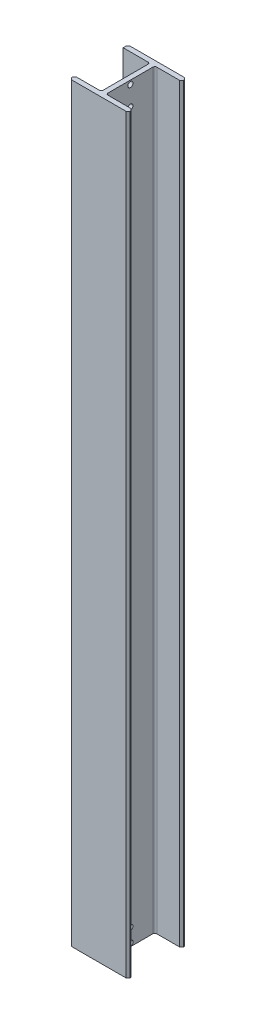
ISO-10303-21;
HEADER;
FILE_DESCRIPTION(('STEP AP214'),'2;1');
FILE_NAME('part.step','',(''),(''),'','','');
FILE_SCHEMA(('AUTOMOTIVE_DESIGN { 1 0 10303 214 1 1 1 1 }'));
ENDSEC;
DATA;
#1=APPLICATION_CONTEXT('core data for automotive mechanical design processes');
#2=APPLICATION_PROTOCOL_DEFINITION('international standard','automotive_design',2000,#1);
#3=PRODUCT_CONTEXT('',#1,'mechanical');
#4=PRODUCT('Part','Part','',(#3));
#5=PRODUCT_RELATED_PRODUCT_CATEGORY('part','',(#4));
#6=PRODUCT_DEFINITION_FORMATION('','',#4);
#7=PRODUCT_DEFINITION_CONTEXT('part definition',#1,'design');
#8=PRODUCT_DEFINITION('design','',#6,#7);
#9=PRODUCT_DEFINITION_SHAPE('','',#8);
#10=(LENGTH_UNIT() NAMED_UNIT(*) SI_UNIT(.MILLI.,.METRE.));
#11=(NAMED_UNIT(*) PLANE_ANGLE_UNIT() SI_UNIT($,.RADIAN.));
#12=(NAMED_UNIT(*) SI_UNIT($,.STERADIAN.) SOLID_ANGLE_UNIT());
#13=UNCERTAINTY_MEASURE_WITH_UNIT(LENGTH_MEASURE(1.E-05),#10,'distance_accuracy_value','');
#14=(GEOMETRIC_REPRESENTATION_CONTEXT(3) GLOBAL_UNCERTAINTY_ASSIGNED_CONTEXT((#13)) GLOBAL_UNIT_ASSIGNED_CONTEXT((#10,
#11,#12)) REPRESENTATION_CONTEXT('',''));
#15=CARTESIAN_POINT('',(0.,0.,0.));
#16=DIRECTION('',(0.,0.,1.));
#17=DIRECTION('',(1.,0.,0.));
#18=AXIS2_PLACEMENT_3D('',#15,#16,#17);
#19=CARTESIAN_POINT('',(0.,977.9,0.));
#20=DIRECTION('',(0.,0.,1.));
#21=DIRECTION('',(1.,0.,0.));
#22=AXIS2_PLACEMENT_3D('',#19,#20,#21);
#23=PLANE('',#22);
#24=DIRECTION('',(-1.,0.,0.));
#25=VECTOR('',#24,1.);
#26=CARTESIAN_POINT('',(34.925,977.9,0.));
#27=LINE('',#26,#25);
#28=CARTESIAN_POINT('',(32.3850000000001,977.9,0.));
#29=VERTEX_POINT('',#28);
#30=CARTESIAN_POINT('',(-38.7350000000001,977.9,0.));
#31=VERTEX_POINT('',#30);
#32=EDGE_CURVE('E246',#29,#31,#27,.T.);
#33=ORIENTED_EDGE('',*,*,#32,.F.);
#34=DIRECTION('',(0.,-1.,0.));
#35=VECTOR('',#34,1.);
#36=CARTESIAN_POINT('',(32.3850000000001,977.9,0.));
#37=LINE('',#36,#35);
#38=CARTESIAN_POINT('',(32.3850000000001,0.,0.));
#39=VERTEX_POINT('',#38);
#40=EDGE_CURVE('E359',#29,#39,#37,.T.);
#41=ORIENTED_EDGE('',*,*,#40,.T.);
#42=DIRECTION('',(-1.,0.,0.));
#43=VECTOR('',#42,1.);
#44=CARTESIAN_POINT('',(0.,0.,0.));
#45=LINE('',#44,#43);
#46=CARTESIAN_POINT('',(-38.7350000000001,0.,0.));
#47=VERTEX_POINT('',#46);
#48=EDGE_CURVE('E203',#39,#47,#45,.T.);
#49=ORIENTED_EDGE('',*,*,#48,.T.);
#50=DIRECTION('',(0.,1.,0.));
#51=VECTOR('',#50,1.);
#52=CARTESIAN_POINT('',(-38.7350000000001,977.9,0.));
#53=LINE('',#52,#51);
#54=EDGE_CURVE('E357',#47,#31,#53,.T.);
#55=ORIENTED_EDGE('',*,*,#54,.T.);
#56=EDGE_LOOP('',(#33,#41,#49,#55));
#57=FACE_BOUND('',#56,.T.);
#58=ADVANCED_FACE('F36',(#57),#23,.F.);
#59=CARTESIAN_POINT('',(-41.275,977.9,0.));
#60=DIRECTION('',(1.,0.,0.));
#61=DIRECTION('',(0.,0.,-1.));
#62=AXIS2_PLACEMENT_3D('',#59,#60,#61);
#63=PLANE('',#62);
#64=DIRECTION('',(0.,0.,1.));
#65=VECTOR('',#64,1.);
#66=CARTESIAN_POINT('',(-41.275,977.9,0.));
#67=LINE('',#66,#65);
#68=CARTESIAN_POINT('',(-41.275,977.9,2.53999999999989));
#69=VERTEX_POINT('',#68);
#70=CARTESIAN_POINT('',(-41.275,977.9,6.35));
#71=VERTEX_POINT('',#70);
#72=EDGE_CURVE('E249',#69,#71,#67,.T.);
#73=ORIENTED_EDGE('',*,*,#72,.F.);
#74=DIRECTION('',(0.,-1.,0.));
#75=VECTOR('',#74,1.);
#76=CARTESIAN_POINT('',(-41.275,977.9,2.53999999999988));
#77=LINE('',#76,#75);
#78=CARTESIAN_POINT('',(-41.275,0.,2.53999999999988));
#79=VERTEX_POINT('',#78);
#80=EDGE_CURVE('E199',#69,#79,#77,.T.);
#81=ORIENTED_EDGE('',*,*,#80,.T.);
#82=DIRECTION('',(0.,0.,1.));
#83=VECTOR('',#82,1.);
#84=CARTESIAN_POINT('',(-41.275,0.,0.));
#85=LINE('',#84,#83);
#86=CARTESIAN_POINT('',(-41.275,0.,6.35));
#87=VERTEX_POINT('',#86);
#88=EDGE_CURVE('E192',#79,#87,#85,.T.);
#89=ORIENTED_EDGE('',*,*,#88,.T.);
#90=DIRECTION('',(0.,-1.,0.));
#91=VECTOR('',#90,1.);
#92=CARTESIAN_POINT('',(-41.275,977.9,6.35));
#93=LINE('',#92,#91);
#94=EDGE_CURVE('E196',#71,#87,#93,.T.);
#95=ORIENTED_EDGE('',*,*,#94,.F.);
#96=EDGE_LOOP('',(#73,#81,#89,#95));
#97=FACE_BOUND('',#96,.T.);
#98=ADVANCED_FACE('F195',(#97),#63,.F.);
#99=CARTESIAN_POINT('',(-41.275,977.9,6.35));
#100=DIRECTION('',(0.,0.,-1.));
#101=DIRECTION('',(-1.,0.,0.));
#102=AXIS2_PLACEMENT_3D('',#99,#100,#101);
#103=PLANE('',#102);
#104=DIRECTION('',(1.,0.,0.));
#105=VECTOR('',#104,1.);
#106=CARTESIAN_POINT('',(-41.275,0.,6.35));
#107=LINE('',#106,#105);
#108=CARTESIAN_POINT('',(-8.89,0.,6.35));
#109=VERTEX_POINT('',#108);
#110=EDGE_CURVE('E202',#87,#109,#107,.T.);
#111=ORIENTED_EDGE('',*,*,#110,.T.);
#112=DIRECTION('',(0.,-1.,0.));
#113=VECTOR('',#112,1.);
#114=CARTESIAN_POINT('',(-8.89,977.9,6.35));
#115=LINE('',#114,#113);
#116=CARTESIAN_POINT('',(-8.89,977.9,6.35));
#117=VERTEX_POINT('',#116);
#118=EDGE_CURVE('E279',#109,#117,#115,.F.);
#119=ORIENTED_EDGE('',*,*,#118,.T.);
#120=DIRECTION('',(1.,0.,0.));
#121=VECTOR('',#120,1.);
#122=CARTESIAN_POINT('',(-41.275,977.9,6.35));
#123=LINE('',#122,#121);
#124=EDGE_CURVE('E210',#71,#117,#123,.T.);
#125=ORIENTED_EDGE('',*,*,#124,.F.);
#126=ORIENTED_EDGE('',*,*,#94,.T.);
#127=EDGE_LOOP('',(#111,#119,#125,#126));
#128=FACE_BOUND('',#127,.T.);
#129=ADVANCED_FACE('F207',(#128),#103,.F.);
#130=CARTESIAN_POINT('',(-6.35,977.9,6.35));
#131=DIRECTION('',(1.,0.,0.));
#132=DIRECTION('',(0.,0.,-1.));
#133=AXIS2_PLACEMENT_3D('',#130,#131,#132);
#134=PLANE('',#133);
#135=CARTESIAN_POINT('',(-6.34999999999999,21.59,38.1));
#136=DIRECTION('',(1.,0.,0.));
#137=DIRECTION('',(0.,0.,-1.));
#138=AXIS2_PLACEMENT_3D('',#135,#136,#137);
#139=CIRCLE('',#138,3.3782);
#140=CARTESIAN_POINT('',(-6.34999999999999,21.59,34.7218));
#141=VERTEX_POINT('',#140);
#142=EDGE_CURVE('E590',#141,#141,#139,.T.);
#143=ORIENTED_EDGE('',*,*,#142,.T.);
#144=EDGE_LOOP('',(#143));
#145=FACE_BOUND('',#144,.T.);
#146=CARTESIAN_POINT('',(-6.34999999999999,3.81,38.1));
#147=DIRECTION('',(1.,0.,0.));
#148=DIRECTION('',(0.,0.,-1.));
#149=AXIS2_PLACEMENT_3D('',#146,#147,#148);
#150=CIRCLE('',#149,3.3782);
#151=CARTESIAN_POINT('',(-6.34999999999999,3.81,34.7218));
#152=VERTEX_POINT('',#151);
#153=EDGE_CURVE('E594',#152,#152,#150,.T.);
#154=ORIENTED_EDGE('',*,*,#153,.T.);
#155=EDGE_LOOP('',(#154));
#156=FACE_BOUND('',#155,.T.);
#157=CARTESIAN_POINT('',(-6.34999999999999,947.42,38.1));
#158=DIRECTION('',(1.,0.,0.));
#159=DIRECTION('',(0.,0.,-1.));
#160=AXIS2_PLACEMENT_3D('',#157,#158,#159);
#161=CIRCLE('',#160,3.3782);
#162=CARTESIAN_POINT('',(-6.34999999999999,947.42,34.7218));
#163=VERTEX_POINT('',#162);
#164=EDGE_CURVE('E603',#163,#163,#161,.T.);
#165=ORIENTED_EDGE('',*,*,#164,.T.);
#166=EDGE_LOOP('',(#165));
#167=FACE_BOUND('',#166,.T.);
#168=CARTESIAN_POINT('',(-6.34999999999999,972.82,38.1));
#169=DIRECTION('',(1.,0.,0.));
#170=DIRECTION('',(0.,0.,-1.));
#171=AXIS2_PLACEMENT_3D('',#168,#169,#170);
#172=CIRCLE('',#171,3.3782);
#173=CARTESIAN_POINT('',(-6.34999999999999,972.82,34.7218));
#174=VERTEX_POINT('',#173);
#175=EDGE_CURVE('E609',#174,#174,#172,.T.);
#176=ORIENTED_EDGE('',*,*,#175,.T.);
#177=EDGE_LOOP('',(#176));
#178=FACE_BOUND('',#177,.T.);
#179=DIRECTION('',(0.,0.,1.));
#180=VECTOR('',#179,1.);
#181=CARTESIAN_POINT('',(-6.35,977.9,6.35));
#182=LINE('',#181,#180);
#183=CARTESIAN_POINT('',(-6.35,977.9,8.89000000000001));
#184=VERTEX_POINT('',#183);
#185=CARTESIAN_POINT('',(-6.34999999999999,977.9,67.31));
#186=VERTEX_POINT('',#185);
#187=EDGE_CURVE('E252',#184,#186,#182,.T.);
#188=ORIENTED_EDGE('',*,*,#187,.F.);
#189=DIRECTION('',(0.,-1.,0.));
#190=VECTOR('',#189,1.);
#191=CARTESIAN_POINT('',(-6.35,0.,8.89000000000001));
#192=LINE('',#191,#190);
#193=CARTESIAN_POINT('',(-6.35,0.,8.89000000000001));
#194=VERTEX_POINT('',#193);
#195=EDGE_CURVE('E276',#184,#194,#192,.T.);
#196=ORIENTED_EDGE('',*,*,#195,.T.);
#197=DIRECTION('',(0.,0.,1.));
#198=VECTOR('',#197,1.);
#199=CARTESIAN_POINT('',(-6.35,0.,6.35));
#200=LINE('',#199,#198);
#201=CARTESIAN_POINT('',(-6.34999999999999,0.,67.31));
#202=VERTEX_POINT('',#201);
#203=EDGE_CURVE('E218',#194,#202,#200,.T.);
#204=ORIENTED_EDGE('',*,*,#203,.T.);
#205=DIRECTION('',(0.,-1.,0.));
#206=VECTOR('',#205,1.);
#207=CARTESIAN_POINT('',(-6.34999999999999,977.9,67.31));
#208=LINE('',#207,#206);
#209=EDGE_CURVE('E211',#202,#186,#208,.F.);
#210=ORIENTED_EDGE('',*,*,#209,.T.);
#211=EDGE_LOOP('',(#188,#196,#204,#210));
#212=FACE_BOUND('',#211,.T.);
#213=ADVANCED_FACE('F452',(#145,#156,#167,#178,#212),#134,.F.);
#214=CARTESIAN_POINT('',(-6.34999999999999,977.9,69.85));
#215=DIRECTION('',(0.,0.,1.));
#216=DIRECTION('',(1.,0.,0.));
#217=AXIS2_PLACEMENT_3D('',#214,#215,#216);
#218=PLANE('',#217);
#219=DIRECTION('',(-1.,0.,0.));
#220=VECTOR('',#219,1.);
#221=CARTESIAN_POINT('',(-6.34999999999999,0.,69.85));
#222=LINE('',#221,#220);
#223=CARTESIAN_POINT('',(-8.88999999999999,0.,69.85));
#224=VERTEX_POINT('',#223);
#225=CARTESIAN_POINT('',(-38.735,0.,69.85));
#226=VERTEX_POINT('',#225);
#227=EDGE_CURVE('E221',#224,#226,#222,.T.);
#228=ORIENTED_EDGE('',*,*,#227,.T.);
#229=DIRECTION('',(0.,1.,0.));
#230=VECTOR('',#229,1.);
#231=CARTESIAN_POINT('',(-38.735,977.9,69.85));
#232=LINE('',#231,#230);
#233=CARTESIAN_POINT('',(-38.735,977.9,69.85));
#234=VERTEX_POINT('',#233);
#235=EDGE_CURVE('E11',#226,#234,#232,.T.);
#236=ORIENTED_EDGE('',*,*,#235,.T.);
#237=DIRECTION('',(-1.,0.,0.));
#238=VECTOR('',#237,1.);
#239=CARTESIAN_POINT('',(-6.34999999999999,977.9,69.85));
#240=LINE('',#239,#238);
#241=CARTESIAN_POINT('',(-8.88999999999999,977.9,69.85));
#242=VERTEX_POINT('',#241);
#243=EDGE_CURVE('E255',#242,#234,#240,.T.);
#244=ORIENTED_EDGE('',*,*,#243,.F.);
#245=DIRECTION('',(0.,-1.,0.));
#246=VECTOR('',#245,1.);
#247=CARTESIAN_POINT('',(-8.88999999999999,0.,69.85));
#248=LINE('',#247,#246);
#249=EDGE_CURVE('E281',#242,#224,#248,.T.);
#250=ORIENTED_EDGE('',*,*,#249,.T.);
#251=EDGE_LOOP('',(#228,#236,#244,#250));
#252=FACE_BOUND('',#251,.T.);
#253=ADVANCED_FACE('F457',(#252),#218,.F.);
#254=CARTESIAN_POINT('',(-41.275,977.9,69.85));
#255=DIRECTION('',(1.,0.,0.));
#256=DIRECTION('',(0.,0.,-1.));
#257=AXIS2_PLACEMENT_3D('',#254,#255,#256);
#258=PLANE('',#257);
#259=DIRECTION('',(0.,0.,1.));
#260=VECTOR('',#259,1.);
#261=CARTESIAN_POINT('',(-41.275,977.9,69.85));
#262=LINE('',#261,#260);
#263=CARTESIAN_POINT('',(-41.275,977.9,72.39));
#264=VERTEX_POINT('',#263);
#265=CARTESIAN_POINT('',(-41.275,977.9,73.6600000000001));
#266=VERTEX_POINT('',#265);
#267=EDGE_CURVE('E258',#264,#266,#262,.T.);
#268=ORIENTED_EDGE('',*,*,#267,.F.);
#269=DIRECTION('',(0.,-1.,0.));
#270=VECTOR('',#269,1.);
#271=CARTESIAN_POINT('',(-41.275,977.9,72.39));
#272=LINE('',#271,#270);
#273=CARTESIAN_POINT('',(-41.275,0.,72.39));
#274=VERTEX_POINT('',#273);
#275=EDGE_CURVE('E43',#264,#274,#272,.T.);
#276=ORIENTED_EDGE('',*,*,#275,.T.);
#277=DIRECTION('',(0.,0.,1.));
#278=VECTOR('',#277,1.);
#279=CARTESIAN_POINT('',(-41.275,0.,69.85));
#280=LINE('',#279,#278);
#281=CARTESIAN_POINT('',(-41.275,0.,73.6600000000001));
#282=VERTEX_POINT('',#281);
#283=EDGE_CURVE('E227',#274,#282,#280,.T.);
#284=ORIENTED_EDGE('',*,*,#283,.T.);
#285=DIRECTION('',(0.,1.,0.));
#286=VECTOR('',#285,1.);
#287=CARTESIAN_POINT('',(-41.275,977.9,73.6600000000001));
#288=LINE('',#287,#286);
#289=EDGE_CURVE('E363',#282,#266,#288,.T.);
#290=ORIENTED_EDGE('',*,*,#289,.T.);
#291=EDGE_LOOP('',(#268,#276,#284,#290));
#292=FACE_BOUND('',#291,.T.);
#293=ADVANCED_FACE('F369',(#292),#258,.F.);
#294=CARTESIAN_POINT('',(-41.275,977.9,76.2));
#295=DIRECTION('',(0.,0.,-1.));
#296=DIRECTION('',(-1.,0.,0.));
#297=AXIS2_PLACEMENT_3D('',#294,#295,#296);
#298=PLANE('',#297);
#299=DIRECTION('',(1.,0.,0.));
#300=VECTOR('',#299,1.);
#301=CARTESIAN_POINT('',(-41.275,0.,76.2));
#302=LINE('',#301,#300);
#303=CARTESIAN_POINT('',(-38.7350000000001,0.,76.2));
#304=VERTEX_POINT('',#303);
#305=CARTESIAN_POINT('',(32.385,0.,76.2));
#306=VERTEX_POINT('',#305);
#307=EDGE_CURVE('E230',#304,#306,#302,.T.);
#308=ORIENTED_EDGE('',*,*,#307,.T.);
#309=DIRECTION('',(0.,1.,0.));
#310=VECTOR('',#309,1.);
#311=CARTESIAN_POINT('',(32.385,977.9,76.2));
#312=LINE('',#311,#310);
#313=CARTESIAN_POINT('',(32.385,977.9,76.2));
#314=VERTEX_POINT('',#313);
#315=EDGE_CURVE('E333',#306,#314,#312,.T.);
#316=ORIENTED_EDGE('',*,*,#315,.T.);
#317=DIRECTION('',(1.,0.,0.));
#318=VECTOR('',#317,1.);
#319=CARTESIAN_POINT('',(-41.275,977.9,76.2));
#320=LINE('',#319,#318);
#321=CARTESIAN_POINT('',(-38.7350000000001,977.9,76.2));
#322=VERTEX_POINT('',#321);
#323=EDGE_CURVE('E261',#322,#314,#320,.T.);
#324=ORIENTED_EDGE('',*,*,#323,.F.);
#325=DIRECTION('',(0.,-1.,0.));
#326=VECTOR('',#325,1.);
#327=CARTESIAN_POINT('',(-38.7350000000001,977.9,76.2));
#328=LINE('',#327,#326);
#329=EDGE_CURVE('E330',#322,#304,#328,.T.);
#330=ORIENTED_EDGE('',*,*,#329,.T.);
#331=EDGE_LOOP('',(#308,#316,#324,#330));
#332=FACE_BOUND('',#331,.T.);
#333=ADVANCED_FACE('F381',(#332),#298,.F.);
#334=CARTESIAN_POINT('',(34.925,977.9,76.2));
#335=DIRECTION('',(-1.,0.,0.));
#336=DIRECTION('',(0.,0.,1.));
#337=AXIS2_PLACEMENT_3D('',#334,#335,#336);
#338=PLANE('',#337);
#339=DIRECTION('',(0.,0.,-1.));
#340=VECTOR('',#339,1.);
#341=CARTESIAN_POINT('',(34.925,977.9,76.2));
#342=LINE('',#341,#340);
#343=CARTESIAN_POINT('',(34.925,977.9,73.66));
#344=VERTEX_POINT('',#343);
#345=CARTESIAN_POINT('',(34.925,977.9,72.3899999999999));
#346=VERTEX_POINT('',#345);
#347=EDGE_CURVE('E264',#344,#346,#342,.T.);
#348=ORIENTED_EDGE('',*,*,#347,.F.);
#349=DIRECTION('',(0.,-1.,0.));
#350=VECTOR('',#349,1.);
#351=CARTESIAN_POINT('',(34.925,977.9,73.66));
#352=LINE('',#351,#350);
#353=CARTESIAN_POINT('',(34.925,0.,73.66));
#354=VERTEX_POINT('',#353);
#355=EDGE_CURVE('E313',#344,#354,#352,.T.);
#356=ORIENTED_EDGE('',*,*,#355,.T.);
#357=DIRECTION('',(0.,0.,-1.));
#358=VECTOR('',#357,1.);
#359=CARTESIAN_POINT('',(34.925,0.,76.2));
#360=LINE('',#359,#358);
#361=CARTESIAN_POINT('',(34.925,0.,72.3899999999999));
#362=VERTEX_POINT('',#361);
#363=EDGE_CURVE('E233',#354,#362,#360,.T.);
#364=ORIENTED_EDGE('',*,*,#363,.T.);
#365=DIRECTION('',(0.,1.,0.));
#366=VECTOR('',#365,1.);
#367=CARTESIAN_POINT('',(34.925,977.9,72.3899999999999));
#368=LINE('',#367,#366);
#369=EDGE_CURVE('E311',#362,#346,#368,.T.);
#370=ORIENTED_EDGE('',*,*,#369,.T.);
#371=EDGE_LOOP('',(#348,#356,#364,#370));
#372=FACE_BOUND('',#371,.T.);
#373=ADVANCED_FACE('F390',(#372),#338,.F.);
#374=CARTESIAN_POINT('',(34.925,977.9,69.85));
#375=DIRECTION('',(0.,0.,1.));
#376=DIRECTION('',(1.,0.,0.));
#377=AXIS2_PLACEMENT_3D('',#374,#375,#376);
#378=PLANE('',#377);
#379=DIRECTION('',(-1.,0.,0.));
#380=VECTOR('',#379,1.);
#381=CARTESIAN_POINT('',(34.925,977.9,69.85));
#382=LINE('',#381,#380);
#383=CARTESIAN_POINT('',(32.3850000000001,977.9,69.85));
#384=VERTEX_POINT('',#383);
#385=CARTESIAN_POINT('',(2.54000000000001,977.9,69.85));
#386=VERTEX_POINT('',#385);
#387=EDGE_CURVE('E267',#384,#386,#382,.T.);
#388=ORIENTED_EDGE('',*,*,#387,.F.);
#389=DIRECTION('',(0.,-1.,0.));
#390=VECTOR('',#389,1.);
#391=CARTESIAN_POINT('',(32.3850000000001,977.9,69.85));
#392=LINE('',#391,#390);
#393=CARTESIAN_POINT('',(32.3850000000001,0.,69.85));
#394=VERTEX_POINT('',#393);
#395=EDGE_CURVE('E348',#384,#394,#392,.T.);
#396=ORIENTED_EDGE('',*,*,#395,.T.);
#397=DIRECTION('',(-1.,0.,0.));
#398=VECTOR('',#397,1.);
#399=CARTESIAN_POINT('',(34.925,0.,69.85));
#400=LINE('',#399,#398);
#401=CARTESIAN_POINT('',(2.54000000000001,0.,69.85));
#402=VERTEX_POINT('',#401);
#403=EDGE_CURVE('E236',#394,#402,#400,.T.);
#404=ORIENTED_EDGE('',*,*,#403,.T.);
#405=DIRECTION('',(0.,-1.,0.));
#406=VECTOR('',#405,1.);
#407=CARTESIAN_POINT('',(2.54,977.9,69.85));
#408=LINE('',#407,#406);
#409=EDGE_CURVE('E289',#402,#386,#408,.F.);
#410=ORIENTED_EDGE('',*,*,#409,.T.);
#411=EDGE_LOOP('',(#388,#396,#404,#410));
#412=FACE_BOUND('',#411,.T.);
#413=ADVANCED_FACE('F399',(#412),#378,.F.);
#414=CARTESIAN_POINT('',(0.,977.9,69.85));
#415=DIRECTION('',(-1.,0.,0.));
#416=DIRECTION('',(0.,0.,1.));
#417=AXIS2_PLACEMENT_3D('',#414,#415,#416);
#418=PLANE('',#417);
#419=CARTESIAN_POINT('',(0.,21.59,38.1));
#420=DIRECTION('',(1.,0.,0.));
#421=DIRECTION('',(0.,0.,-1.));
#422=AXIS2_PLACEMENT_3D('',#419,#420,#421);
#423=CIRCLE('',#422,3.3782);
#424=CARTESIAN_POINT('',(0.,21.59,34.7218));
#425=VERTEX_POINT('',#424);
#426=EDGE_CURVE('E587',#425,#425,#423,.T.);
#427=ORIENTED_EDGE('',*,*,#426,.F.);
#428=EDGE_LOOP('',(#427));
#429=FACE_BOUND('',#428,.T.);
#430=CARTESIAN_POINT('',(0.,3.81,38.1));
#431=DIRECTION('',(1.,0.,0.));
#432=DIRECTION('',(0.,0.,-1.));
#433=AXIS2_PLACEMENT_3D('',#430,#431,#432);
#434=CIRCLE('',#433,3.3782);
#435=CARTESIAN_POINT('',(0.,3.81,34.7218));
#436=VERTEX_POINT('',#435);
#437=EDGE_CURVE('E591',#436,#436,#434,.T.);
#438=ORIENTED_EDGE('',*,*,#437,.F.);
#439=EDGE_LOOP('',(#438));
#440=FACE_BOUND('',#439,.T.);
#441=CARTESIAN_POINT('',(0.,947.42,38.1));
#442=DIRECTION('',(1.,0.,0.));
#443=DIRECTION('',(0.,0.,-1.));
#444=AXIS2_PLACEMENT_3D('',#441,#442,#443);
#445=CIRCLE('',#444,3.3782);
#446=CARTESIAN_POINT('',(0.,947.42,34.7218));
#447=VERTEX_POINT('',#446);
#448=EDGE_CURVE('E600',#447,#447,#445,.T.);
#449=ORIENTED_EDGE('',*,*,#448,.F.);
#450=EDGE_LOOP('',(#449));
#451=FACE_BOUND('',#450,.T.);
#452=CARTESIAN_POINT('',(0.,972.82,38.1));
#453=DIRECTION('',(1.,0.,0.));
#454=DIRECTION('',(0.,0.,-1.));
#455=AXIS2_PLACEMENT_3D('',#452,#453,#454);
#456=CIRCLE('',#455,3.3782);
#457=CARTESIAN_POINT('',(0.,972.82,34.7218));
#458=VERTEX_POINT('',#457);
#459=EDGE_CURVE('E606',#458,#458,#456,.T.);
#460=ORIENTED_EDGE('',*,*,#459,.F.);
#461=EDGE_LOOP('',(#460));
#462=FACE_BOUND('',#461,.T.);
#463=DIRECTION('',(0.,0.,-1.));
#464=VECTOR('',#463,1.);
#465=CARTESIAN_POINT('',(0.,977.9,69.85));
#466=LINE('',#465,#464);
#467=CARTESIAN_POINT('',(0.,977.9,67.31));
#468=VERTEX_POINT('',#467);
#469=CARTESIAN_POINT('',(0.,977.9,8.89));
#470=VERTEX_POINT('',#469);
#471=EDGE_CURVE('E269',#468,#470,#466,.T.);
#472=ORIENTED_EDGE('',*,*,#471,.F.);
#473=DIRECTION('',(0.,-1.,0.));
#474=VECTOR('',#473,1.);
#475=CARTESIAN_POINT('',(0.,0.,67.31));
#476=LINE('',#475,#474);
#477=CARTESIAN_POINT('',(0.,0.,67.31));
#478=VERTEX_POINT('',#477);
#479=EDGE_CURVE('E286',#468,#478,#476,.T.);
#480=ORIENTED_EDGE('',*,*,#479,.T.);
#481=DIRECTION('',(0.,0.,-1.));
#482=VECTOR('',#481,1.);
#483=CARTESIAN_POINT('',(0.,0.,69.85));
#484=LINE('',#483,#482);
#485=CARTESIAN_POINT('',(0.,0.,8.89));
#486=VERTEX_POINT('',#485);
#487=EDGE_CURVE('E238',#478,#486,#484,.T.);
#488=ORIENTED_EDGE('',*,*,#487,.T.);
#489=DIRECTION('',(0.,-1.,0.));
#490=VECTOR('',#489,1.);
#491=CARTESIAN_POINT('',(0.,977.9,8.89));
#492=LINE('',#491,#490);
#493=EDGE_CURVE('E284',#486,#470,#492,.F.);
#494=ORIENTED_EDGE('',*,*,#493,.T.);
#495=EDGE_LOOP('',(#472,#480,#488,#494));
#496=FACE_BOUND('',#495,.T.);
#497=ADVANCED_FACE('F407',(#429,#440,#451,#462,#496),#418,.F.);
#498=CARTESIAN_POINT('',(0.,977.9,6.35));
#499=DIRECTION('',(0.,0.,-1.));
#500=DIRECTION('',(-1.,0.,0.));
#501=AXIS2_PLACEMENT_3D('',#498,#499,#500);
#502=PLANE('',#501);
#503=DIRECTION('',(1.,0.,0.));
#504=VECTOR('',#503,1.);
#505=CARTESIAN_POINT('',(0.,0.,6.35));
#506=LINE('',#505,#504);
#507=CARTESIAN_POINT('',(2.54,0.,6.35));
#508=VERTEX_POINT('',#507);
#509=CARTESIAN_POINT('',(32.3850000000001,0.,6.35));
#510=VERTEX_POINT('',#509);
#511=EDGE_CURVE('E241',#508,#510,#506,.T.);
#512=ORIENTED_EDGE('',*,*,#511,.T.);
#513=DIRECTION('',(0.,1.,0.));
#514=VECTOR('',#513,1.);
#515=CARTESIAN_POINT('',(32.3850000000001,977.9,6.35));
#516=LINE('',#515,#514);
#517=CARTESIAN_POINT('',(32.3850000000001,977.9,6.35));
#518=VERTEX_POINT('',#517);
#519=EDGE_CURVE('E355',#510,#518,#516,.T.);
#520=ORIENTED_EDGE('',*,*,#519,.T.);
#521=DIRECTION('',(1.,0.,0.));
#522=VECTOR('',#521,1.);
#523=CARTESIAN_POINT('',(0.,977.9,6.35));
#524=LINE('',#523,#522);
#525=CARTESIAN_POINT('',(2.54,977.9,6.35));
#526=VERTEX_POINT('',#525);
#527=EDGE_CURVE('E272',#526,#518,#524,.T.);
#528=ORIENTED_EDGE('',*,*,#527,.F.);
#529=DIRECTION('',(0.,-1.,0.));
#530=VECTOR('',#529,1.);
#531=CARTESIAN_POINT('',(2.54,0.,6.35));
#532=LINE('',#531,#530);
#533=EDGE_CURVE('E292',#526,#508,#532,.T.);
#534=ORIENTED_EDGE('',*,*,#533,.T.);
#535=EDGE_LOOP('',(#512,#520,#528,#534));
#536=FACE_BOUND('',#535,.T.);
#537=ADVANCED_FACE('F417',(#536),#502,.F.);
#538=CARTESIAN_POINT('',(34.925,977.9,6.35));
#539=DIRECTION('',(-1.,0.,0.));
#540=DIRECTION('',(0.,0.,1.));
#541=AXIS2_PLACEMENT_3D('',#538,#539,#540);
#542=PLANE('',#541);
#543=DIRECTION('',(0.,0.,-1.));
#544=VECTOR('',#543,1.);
#545=CARTESIAN_POINT('',(34.925,977.9,6.35));
#546=LINE('',#545,#544);
#547=CARTESIAN_POINT('',(34.925,977.9,3.81000000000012));
#548=VERTEX_POINT('',#547);
#549=CARTESIAN_POINT('',(34.925,977.9,2.53999999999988));
#550=VERTEX_POINT('',#549);
#551=EDGE_CURVE('E212',#548,#550,#546,.T.);
#552=ORIENTED_EDGE('',*,*,#551,.F.);
#553=DIRECTION('',(0.,-1.,0.));
#554=VECTOR('',#553,1.);
#555=CARTESIAN_POINT('',(34.925,977.9,3.81000000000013));
#556=LINE('',#555,#554);
#557=CARTESIAN_POINT('',(34.925,0.,3.81000000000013));
#558=VERTEX_POINT('',#557);
#559=EDGE_CURVE('E352',#548,#558,#556,.T.);
#560=ORIENTED_EDGE('',*,*,#559,.T.);
#561=DIRECTION('',(0.,0.,-1.));
#562=VECTOR('',#561,1.);
#563=CARTESIAN_POINT('',(34.925,0.,6.35));
#564=LINE('',#563,#562);
#565=CARTESIAN_POINT('',(34.925,0.,2.53999999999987));
#566=VERTEX_POINT('',#565);
#567=EDGE_CURVE('E244',#558,#566,#564,.T.);
#568=ORIENTED_EDGE('',*,*,#567,.T.);
#569=DIRECTION('',(0.,1.,0.));
#570=VECTOR('',#569,1.);
#571=CARTESIAN_POINT('',(34.925,977.9,2.53999999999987));
#572=LINE('',#571,#570);
#573=EDGE_CURVE('E50',#566,#550,#572,.T.);
#574=ORIENTED_EDGE('',*,*,#573,.T.);
#575=EDGE_LOOP('',(#552,#560,#568,#574));
#576=FACE_BOUND('',#575,.T.);
#577=ADVANCED_FACE('F423',(#576),#542,.F.);
#578=CARTESIAN_POINT('',(-6.35,977.9,0.));
#579=DIRECTION('',(0.,1.,0.));
#580=DIRECTION('',(0.,0.,1.));
#581=AXIS2_PLACEMENT_3D('',#578,#579,#580);
#582=PLANE('',#581);
#583=ORIENTED_EDGE('',*,*,#323,.T.);
#584=DIRECTION('',(-0.707106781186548,0.,0.707106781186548));
#585=VECTOR('',#584,1.);
#586=CARTESIAN_POINT('',(51.1175,977.9,57.4675));
#587=LINE('',#586,#585);
#588=EDGE_CURVE('E346',#314,#344,#587,.F.);
#589=ORIENTED_EDGE('',*,*,#588,.T.);
#590=ORIENTED_EDGE('',*,*,#347,.T.);
#591=DIRECTION('',(0.707106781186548,0.,0.707106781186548));
#592=VECTOR('',#591,1.);
#593=CARTESIAN_POINT('',(-21.9074999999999,977.9,15.5574999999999));
#594=LINE('',#593,#592);
#595=EDGE_CURVE('E344',#346,#384,#594,.F.);
#596=ORIENTED_EDGE('',*,*,#595,.T.);
#597=ORIENTED_EDGE('',*,*,#387,.T.);
#598=CARTESIAN_POINT('',(2.54,977.9,67.31));
#599=DIRECTION('',(0.,1.,0.));
#600=DIRECTION('',(0.,0.,1.));
#601=AXIS2_PLACEMENT_3D('',#598,#599,#600);
#602=CIRCLE('',#601,2.54);
#603=EDGE_CURVE('E305',#386,#468,#602,.F.);
#604=ORIENTED_EDGE('',*,*,#603,.T.);
#605=ORIENTED_EDGE('',*,*,#471,.T.);
#606=CARTESIAN_POINT('',(2.54,977.9,8.89));
#607=DIRECTION('',(0.,1.,0.));
#608=DIRECTION('',(0.,0.,1.));
#609=AXIS2_PLACEMENT_3D('',#606,#607,#608);
#610=CIRCLE('',#609,2.54);
#611=EDGE_CURVE('E309',#470,#526,#610,.F.);
#612=ORIENTED_EDGE('',*,*,#611,.T.);
#613=ORIENTED_EDGE('',*,*,#527,.T.);
#614=DIRECTION('',(-0.707106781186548,0.,0.707106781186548));
#615=VECTOR('',#614,1.);
#616=CARTESIAN_POINT('',(16.1925000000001,977.9,22.5425000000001));
#617=LINE('',#616,#615);
#618=EDGE_CURVE('E57',#518,#548,#617,.F.);
#619=ORIENTED_EDGE('',*,*,#618,.T.);
#620=ORIENTED_EDGE('',*,*,#551,.T.);
#621=DIRECTION('',(0.707106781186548,0.,0.707106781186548));
#622=VECTOR('',#621,1.);
#623=CARTESIAN_POINT('',(13.0175000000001,977.9,-19.3675000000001));
#624=LINE('',#623,#622);
#625=EDGE_CURVE('E341',#550,#29,#624,.F.);
#626=ORIENTED_EDGE('',*,*,#625,.T.);
#627=ORIENTED_EDGE('',*,*,#32,.T.);
#628=DIRECTION('',(0.707106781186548,0.,-0.707106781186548));
#629=VECTOR('',#628,1.);
#630=CARTESIAN_POINT('',(-22.5425000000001,977.9,-16.1925000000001));
#631=LINE('',#630,#629);
#632=EDGE_CURVE('E339',#31,#69,#631,.F.);
#633=ORIENTED_EDGE('',*,*,#632,.T.);
#634=ORIENTED_EDGE('',*,*,#72,.T.);
#635=ORIENTED_EDGE('',*,*,#124,.T.);
#636=CARTESIAN_POINT('',(-8.89,977.9,8.89000000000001));
#637=DIRECTION('',(0.,1.,0.));
#638=DIRECTION('',(0.,0.,1.));
#639=AXIS2_PLACEMENT_3D('',#636,#637,#638);
#640=CIRCLE('',#639,2.54);
#641=EDGE_CURVE('E296',#117,#184,#640,.F.);
#642=ORIENTED_EDGE('',*,*,#641,.T.);
#643=ORIENTED_EDGE('',*,*,#187,.T.);
#644=CARTESIAN_POINT('',(-8.89,977.9,67.31));
#645=DIRECTION('',(0.,1.,0.));
#646=DIRECTION('',(0.,0.,1.));
#647=AXIS2_PLACEMENT_3D('',#644,#645,#646);
#648=CIRCLE('',#647,2.54);
#649=EDGE_CURVE('E300',#186,#242,#648,.F.);
#650=ORIENTED_EDGE('',*,*,#649,.T.);
#651=ORIENTED_EDGE('',*,*,#243,.T.);
#652=DIRECTION('',(0.707106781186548,0.,-0.707106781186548));
#653=VECTOR('',#652,1.);
#654=CARTESIAN_POINT('',(12.3825,977.9,18.7325));
#655=LINE('',#654,#653);
#656=EDGE_CURVE('E337',#234,#264,#655,.F.);
#657=ORIENTED_EDGE('',*,*,#656,.T.);
#658=ORIENTED_EDGE('',*,*,#267,.T.);
#659=DIRECTION('',(-0.707106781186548,0.,-0.707106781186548));
#660=VECTOR('',#659,1.);
#661=CARTESIAN_POINT('',(-60.6425000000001,977.9,54.2925000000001));
#662=LINE('',#661,#660);
#663=EDGE_CURVE('E335',#266,#322,#662,.F.);
#664=ORIENTED_EDGE('',*,*,#663,.T.);
#665=EDGE_LOOP('',(#583,#589,#590,#596,#597,#604,#605,#612,#613,#619,#620,#626,#627,#633,#634,
#635,#642,#643,#650,#651,#657,#658,#664));
#666=FACE_BOUND('',#665,.T.);
#667=ADVANCED_FACE('F384',(#666),#582,.T.);
#668=CARTESIAN_POINT('',(-6.35,0.,0.));
#669=DIRECTION('',(0.,1.,0.));
#670=DIRECTION('',(0.,0.,1.));
#671=AXIS2_PLACEMENT_3D('',#668,#669,#670);
#672=PLANE('',#671);
#673=ORIENTED_EDGE('',*,*,#363,.F.);
#674=DIRECTION('',(0.707106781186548,0.,-0.707106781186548));
#675=VECTOR('',#674,1.);
#676=CARTESIAN_POINT('',(34.925,0.,73.66));
#677=LINE('',#676,#675);
#678=EDGE_CURVE('E328',#354,#306,#677,.F.);
#679=ORIENTED_EDGE('',*,*,#678,.T.);
#680=ORIENTED_EDGE('',*,*,#307,.F.);
#681=DIRECTION('',(0.707106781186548,0.,0.707106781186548));
#682=VECTOR('',#681,1.);
#683=CARTESIAN_POINT('',(-38.7350000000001,0.,76.2));
#684=LINE('',#683,#682);
#685=EDGE_CURVE('E316',#304,#282,#684,.F.);
#686=ORIENTED_EDGE('',*,*,#685,.T.);
#687=ORIENTED_EDGE('',*,*,#283,.F.);
#688=DIRECTION('',(-0.707106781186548,0.,0.707106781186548));
#689=VECTOR('',#688,1.);
#690=CARTESIAN_POINT('',(-41.275,0.,72.39));
#691=LINE('',#690,#689);
#692=EDGE_CURVE('E318',#274,#226,#691,.F.);
#693=ORIENTED_EDGE('',*,*,#692,.T.);
#694=ORIENTED_EDGE('',*,*,#227,.F.);
#695=CARTESIAN_POINT('',(-8.89,0.,67.31));
#696=DIRECTION('',(0.,1.,0.));
#697=DIRECTION('',(0.,0.,1.));
#698=AXIS2_PLACEMENT_3D('',#695,#696,#697);
#699=CIRCLE('',#698,2.54);
#700=EDGE_CURVE('E298',#224,#202,#699,.T.);
#701=ORIENTED_EDGE('',*,*,#700,.T.);
#702=ORIENTED_EDGE('',*,*,#203,.F.);
#703=CARTESIAN_POINT('',(-8.89,0.,8.89000000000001));
#704=DIRECTION('',(0.,1.,0.));
#705=DIRECTION('',(0.,0.,1.));
#706=AXIS2_PLACEMENT_3D('',#703,#704,#705);
#707=CIRCLE('',#706,2.54);
#708=EDGE_CURVE('E217',#194,#109,#707,.T.);
#709=ORIENTED_EDGE('',*,*,#708,.T.);
#710=ORIENTED_EDGE('',*,*,#110,.F.);
#711=ORIENTED_EDGE('',*,*,#88,.F.);
#712=DIRECTION('',(-0.707106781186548,0.,0.707106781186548));
#713=VECTOR('',#712,1.);
#714=CARTESIAN_POINT('',(-41.275,0.,2.53999999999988));
#715=LINE('',#714,#713);
#716=EDGE_CURVE('E320',#79,#47,#715,.F.);
#717=ORIENTED_EDGE('',*,*,#716,.T.);
#718=ORIENTED_EDGE('',*,*,#48,.F.);
#719=DIRECTION('',(-0.707106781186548,0.,-0.707106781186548));
#720=VECTOR('',#719,1.);
#721=CARTESIAN_POINT('',(32.3850000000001,0.,0.));
#722=LINE('',#721,#720);
#723=EDGE_CURVE('E322',#39,#566,#722,.F.);
#724=ORIENTED_EDGE('',*,*,#723,.T.);
#725=ORIENTED_EDGE('',*,*,#567,.F.);
#726=DIRECTION('',(0.707106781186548,0.,-0.707106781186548));
#727=VECTOR('',#726,1.);
#728=CARTESIAN_POINT('',(34.925,0.,3.81000000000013));
#729=LINE('',#728,#727);
#730=EDGE_CURVE('E324',#558,#510,#729,.F.);
#731=ORIENTED_EDGE('',*,*,#730,.T.);
#732=ORIENTED_EDGE('',*,*,#511,.F.);
#733=CARTESIAN_POINT('',(2.54,0.,8.89));
#734=DIRECTION('',(0.,1.,0.));
#735=DIRECTION('',(0.,0.,1.));
#736=AXIS2_PLACEMENT_3D('',#733,#734,#735);
#737=CIRCLE('',#736,2.54);
#738=EDGE_CURVE('E307',#508,#486,#737,.T.);
#739=ORIENTED_EDGE('',*,*,#738,.T.);
#740=ORIENTED_EDGE('',*,*,#487,.F.);
#741=CARTESIAN_POINT('',(2.54,0.,67.31));
#742=DIRECTION('',(0.,1.,0.));
#743=DIRECTION('',(0.,0.,1.));
#744=AXIS2_PLACEMENT_3D('',#741,#742,#743);
#745=CIRCLE('',#744,2.54);
#746=EDGE_CURVE('E302',#478,#402,#745,.T.);
#747=ORIENTED_EDGE('',*,*,#746,.T.);
#748=ORIENTED_EDGE('',*,*,#403,.F.);
#749=DIRECTION('',(-0.707106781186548,0.,-0.707106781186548));
#750=VECTOR('',#749,1.);
#751=CARTESIAN_POINT('',(32.3850000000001,0.,69.85));
#752=LINE('',#751,#750);
#753=EDGE_CURVE('E326',#394,#362,#752,.F.);
#754=ORIENTED_EDGE('',*,*,#753,.T.);
#755=EDGE_LOOP('',(#673,#679,#680,#686,#687,#693,#694,#701,#702,#709,#710,#711,#717,#718,#724,
#725,#731,#732,#739,#740,#747,#748,#754));
#756=FACE_BOUND('',#755,.T.);
#757=ADVANCED_FACE('F215',(#756),#672,.F.);
#758=CARTESIAN_POINT('',(-8.89,977.9,8.89000000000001));
#759=DIRECTION('',(0.,1.,0.));
#760=DIRECTION('',(0.,0.,1.));
#761=AXIS2_PLACEMENT_3D('',#758,#759,#760);
#762=CYLINDRICAL_SURFACE('',#761,2.54);
#763=ORIENTED_EDGE('',*,*,#641,.F.);
#764=ORIENTED_EDGE('',*,*,#118,.F.);
#765=ORIENTED_EDGE('',*,*,#708,.F.);
#766=ORIENTED_EDGE('',*,*,#195,.F.);
#767=EDGE_LOOP('',(#763,#764,#765,#766));
#768=FACE_BOUND('',#767,.T.);
#769=ADVANCED_FACE('F481',(#768),#762,.F.);
#770=CARTESIAN_POINT('',(-8.89,977.9,67.31));
#771=DIRECTION('',(0.,1.,0.));
#772=DIRECTION('',(0.,0.,1.));
#773=AXIS2_PLACEMENT_3D('',#770,#771,#772);
#774=CYLINDRICAL_SURFACE('',#773,2.54);
#775=ORIENTED_EDGE('',*,*,#649,.F.);
#776=ORIENTED_EDGE('',*,*,#209,.F.);
#777=ORIENTED_EDGE('',*,*,#700,.F.);
#778=ORIENTED_EDGE('',*,*,#249,.F.);
#779=EDGE_LOOP('',(#775,#776,#777,#778));
#780=FACE_BOUND('',#779,.T.);
#781=ADVANCED_FACE('F484',(#780),#774,.F.);
#782=CARTESIAN_POINT('',(2.54,977.9,67.31));
#783=DIRECTION('',(0.,1.,0.));
#784=DIRECTION('',(0.,0.,1.));
#785=AXIS2_PLACEMENT_3D('',#782,#783,#784);
#786=CYLINDRICAL_SURFACE('',#785,2.54);
#787=ORIENTED_EDGE('',*,*,#603,.F.);
#788=ORIENTED_EDGE('',*,*,#409,.F.);
#789=ORIENTED_EDGE('',*,*,#746,.F.);
#790=ORIENTED_EDGE('',*,*,#479,.F.);
#791=EDGE_LOOP('',(#787,#788,#789,#790));
#792=FACE_BOUND('',#791,.T.);
#793=ADVANCED_FACE('F410',(#792),#786,.F.);
#794=CARTESIAN_POINT('',(2.54,977.9,8.89));
#795=DIRECTION('',(0.,1.,0.));
#796=DIRECTION('',(0.,0.,1.));
#797=AXIS2_PLACEMENT_3D('',#794,#795,#796);
#798=CYLINDRICAL_SURFACE('',#797,2.54);
#799=ORIENTED_EDGE('',*,*,#611,.F.);
#800=ORIENTED_EDGE('',*,*,#493,.F.);
#801=ORIENTED_EDGE('',*,*,#738,.F.);
#802=ORIENTED_EDGE('',*,*,#533,.F.);
#803=EDGE_LOOP('',(#799,#800,#801,#802));
#804=FACE_BOUND('',#803,.T.);
#805=ADVANCED_FACE('F413',(#804),#798,.F.);
#806=CARTESIAN_POINT('',(34.925,977.9,73.66));
#807=DIRECTION('',(-0.707106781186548,0.,-0.707106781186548));
#808=DIRECTION('',(-0.707106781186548,0.,0.707106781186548));
#809=AXIS2_PLACEMENT_3D('',#806,#807,#808);
#810=PLANE('',#809);
#811=ORIENTED_EDGE('',*,*,#588,.F.);
#812=ORIENTED_EDGE('',*,*,#315,.F.);
#813=ORIENTED_EDGE('',*,*,#678,.F.);
#814=ORIENTED_EDGE('',*,*,#355,.F.);
#815=EDGE_LOOP('',(#811,#812,#813,#814));
#816=FACE_BOUND('',#815,.T.);
#817=ADVANCED_FACE('F388',(#816),#810,.F.);
#818=CARTESIAN_POINT('',(32.3850000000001,977.9,69.85));
#819=DIRECTION('',(-0.707106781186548,0.,0.707106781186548));
#820=DIRECTION('',(0.707106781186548,0.,0.707106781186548));
#821=AXIS2_PLACEMENT_3D('',#818,#819,#820);
#822=PLANE('',#821);
#823=ORIENTED_EDGE('',*,*,#595,.F.);
#824=ORIENTED_EDGE('',*,*,#369,.F.);
#825=ORIENTED_EDGE('',*,*,#753,.F.);
#826=ORIENTED_EDGE('',*,*,#395,.F.);
#827=EDGE_LOOP('',(#823,#824,#825,#826));
#828=FACE_BOUND('',#827,.T.);
#829=ADVANCED_FACE('F396',(#828),#822,.F.);
#830=CARTESIAN_POINT('',(34.925,977.9,3.81000000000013));
#831=DIRECTION('',(-0.707106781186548,0.,-0.707106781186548));
#832=DIRECTION('',(-0.707106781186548,0.,0.707106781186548));
#833=AXIS2_PLACEMENT_3D('',#830,#831,#832);
#834=PLANE('',#833);
#835=ORIENTED_EDGE('',*,*,#618,.F.);
#836=ORIENTED_EDGE('',*,*,#519,.F.);
#837=ORIENTED_EDGE('',*,*,#730,.F.);
#838=ORIENTED_EDGE('',*,*,#559,.F.);
#839=EDGE_LOOP('',(#835,#836,#837,#838));
#840=FACE_BOUND('',#839,.T.);
#841=ADVANCED_FACE('F420',(#840),#834,.F.);
#842=CARTESIAN_POINT('',(32.3850000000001,977.9,0.));
#843=DIRECTION('',(-0.707106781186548,0.,0.707106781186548));
#844=DIRECTION('',(0.707106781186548,0.,0.707106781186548));
#845=AXIS2_PLACEMENT_3D('',#842,#843,#844);
#846=PLANE('',#845);
#847=ORIENTED_EDGE('',*,*,#625,.F.);
#848=ORIENTED_EDGE('',*,*,#573,.F.);
#849=ORIENTED_EDGE('',*,*,#723,.F.);
#850=ORIENTED_EDGE('',*,*,#40,.F.);
#851=EDGE_LOOP('',(#847,#848,#849,#850));
#852=FACE_BOUND('',#851,.T.);
#853=ADVANCED_FACE('F429',(#852),#846,.F.);
#854=CARTESIAN_POINT('',(-41.275,977.9,2.53999999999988));
#855=DIRECTION('',(0.707106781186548,0.,0.707106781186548));
#856=DIRECTION('',(0.707106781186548,0.,-0.707106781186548));
#857=AXIS2_PLACEMENT_3D('',#854,#855,#856);
#858=PLANE('',#857);
#859=ORIENTED_EDGE('',*,*,#632,.F.);
#860=ORIENTED_EDGE('',*,*,#54,.F.);
#861=ORIENTED_EDGE('',*,*,#716,.F.);
#862=ORIENTED_EDGE('',*,*,#80,.F.);
#863=EDGE_LOOP('',(#859,#860,#861,#862));
#864=FACE_BOUND('',#863,.T.);
#865=ADVANCED_FACE('F435',(#864),#858,.F.);
#866=CARTESIAN_POINT('',(-41.275,977.9,72.39));
#867=DIRECTION('',(0.707106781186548,0.,0.707106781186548));
#868=DIRECTION('',(0.707106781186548,0.,-0.707106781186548));
#869=AXIS2_PLACEMENT_3D('',#866,#867,#868);
#870=PLANE('',#869);
#871=ORIENTED_EDGE('',*,*,#656,.F.);
#872=ORIENTED_EDGE('',*,*,#235,.F.);
#873=ORIENTED_EDGE('',*,*,#692,.F.);
#874=ORIENTED_EDGE('',*,*,#275,.F.);
#875=EDGE_LOOP('',(#871,#872,#873,#874));
#876=FACE_BOUND('',#875,.T.);
#877=ADVANCED_FACE('F437',(#876),#870,.F.);
#878=CARTESIAN_POINT('',(-38.7350000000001,977.9,76.2));
#879=DIRECTION('',(0.707106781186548,0.,-0.707106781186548));
#880=DIRECTION('',(-0.707106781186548,0.,-0.707106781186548));
#881=AXIS2_PLACEMENT_3D('',#878,#879,#880);
#882=PLANE('',#881);
#883=ORIENTED_EDGE('',*,*,#663,.F.);
#884=ORIENTED_EDGE('',*,*,#289,.F.);
#885=ORIENTED_EDGE('',*,*,#685,.F.);
#886=ORIENTED_EDGE('',*,*,#329,.F.);
#887=EDGE_LOOP('',(#883,#884,#885,#886));
#888=FACE_BOUND('',#887,.T.);
#889=ADVANCED_FACE('F378',(#888),#882,.F.);
#890=CARTESIAN_POINT('',(-41.275,972.82,38.1));
#891=DIRECTION('',(1.,0.,0.));
#892=DIRECTION('',(0.,0.,-1.));
#893=AXIS2_PLACEMENT_3D('',#890,#891,#892);
#894=CYLINDRICAL_SURFACE('',#893,3.3782);
#895=ORIENTED_EDGE('',*,*,#459,.T.);
#896=EDGE_LOOP('',(#895));
#897=FACE_BOUND('',#896,.T.);
#898=ORIENTED_EDGE('',*,*,#175,.F.);
#899=EDGE_LOOP('',(#898));
#900=FACE_BOUND('',#899,.T.);
#901=ADVANCED_FACE('F525',(#897,#900),#894,.F.);
#902=CARTESIAN_POINT('',(-41.275,947.42,38.1));
#903=DIRECTION('',(1.,0.,0.));
#904=DIRECTION('',(0.,0.,-1.));
#905=AXIS2_PLACEMENT_3D('',#902,#903,#904);
#906=CYLINDRICAL_SURFACE('',#905,3.3782);
#907=ORIENTED_EDGE('',*,*,#448,.T.);
#908=EDGE_LOOP('',(#907));
#909=FACE_BOUND('',#908,.T.);
#910=ORIENTED_EDGE('',*,*,#164,.F.);
#911=EDGE_LOOP('',(#910));
#912=FACE_BOUND('',#911,.T.);
#913=ADVANCED_FACE('F550',(#909,#912),#906,.F.);
#914=CARTESIAN_POINT('',(-41.275,3.81,38.1));
#915=DIRECTION('',(1.,0.,0.));
#916=DIRECTION('',(0.,0.,-1.));
#917=AXIS2_PLACEMENT_3D('',#914,#915,#916);
#918=CYLINDRICAL_SURFACE('',#917,3.3782);
#919=ORIENTED_EDGE('',*,*,#437,.T.);
#920=EDGE_LOOP('',(#919));
#921=FACE_BOUND('',#920,.T.);
#922=ORIENTED_EDGE('',*,*,#153,.F.);
#923=EDGE_LOOP('',(#922));
#924=FACE_BOUND('',#923,.T.);
#925=ADVANCED_FACE('F560',(#921,#924),#918,.F.);
#926=CARTESIAN_POINT('',(-41.275,21.59,38.1));
#927=DIRECTION('',(1.,0.,0.));
#928=DIRECTION('',(0.,0.,-1.));
#929=AXIS2_PLACEMENT_3D('',#926,#927,#928);
#930=CYLINDRICAL_SURFACE('',#929,3.3782);
#931=ORIENTED_EDGE('',*,*,#426,.T.);
#932=EDGE_LOOP('',(#931));
#933=FACE_BOUND('',#932,.T.);
#934=ORIENTED_EDGE('',*,*,#142,.F.);
#935=EDGE_LOOP('',(#934));
#936=FACE_BOUND('',#935,.T.);
#937=ADVANCED_FACE('F570',(#933,#936),#930,.F.);
#938=CLOSED_SHELL('',(#58,#98,#129,#213,#253,#293,#333,#373,#413,#497,#537,#577,#667,#757,#769,
#781,#793,#805,#817,#829,#841,#853,#865,#877,#889,#901,#913,#925,#937));
#939=MANIFOLD_SOLID_BREP('B2',#938);
#940=ADVANCED_BREP_SHAPE_REPRESENTATION('',(#18,#939),#14);
#941=SHAPE_DEFINITION_REPRESENTATION(#9,#940);
ENDSEC;
END-ISO-10303-21;
